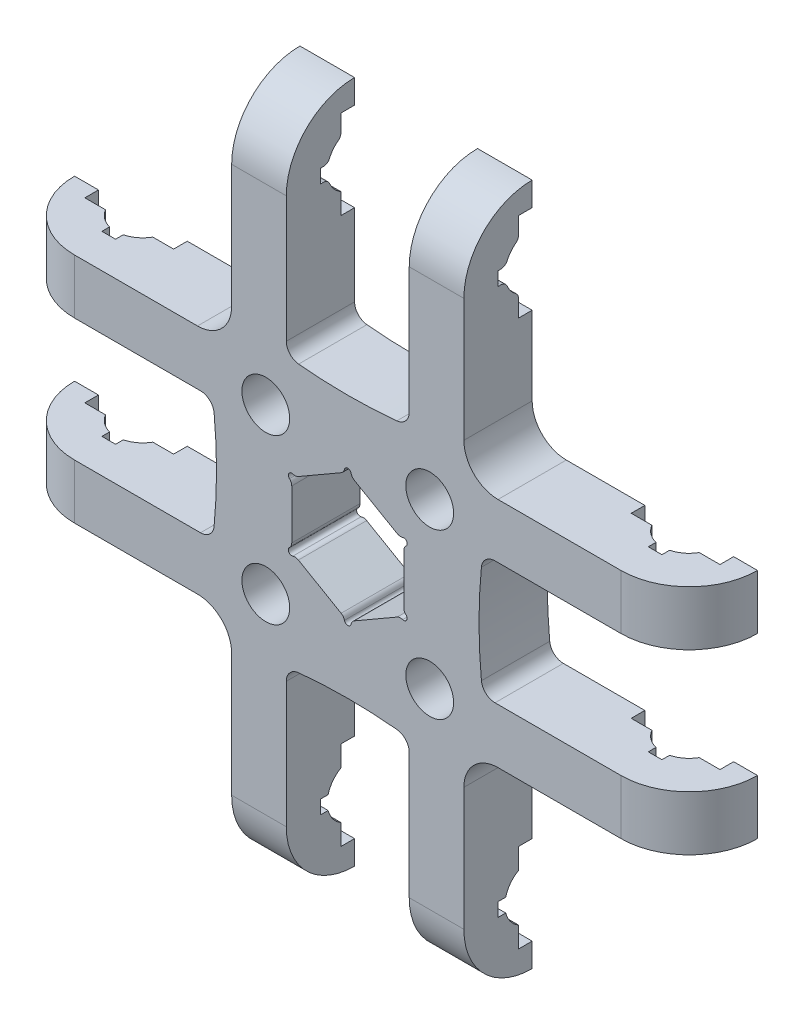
from build123d import *

# Parameters (mm, degrees)
BOSS_EXTRUDE1_DEPTH     = 10
SKETCH4_R               = 2
SKETCH4_W               = 2
SKETCH4_H               = 6.5
SKETCH4_W_2             = 5
SKETCH4_H_2             = 1
CUT_EXTRUDE3_DEPTH      = 46.885165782
SKETCH4_4_W             = 10
SKETCH4_4_H             = 0.975926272
CUT_EXTRUDE4_DEPTH      = 46.885165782
CIRPATTERN1_COUNT       = 4
FILLET1_R               = 2.5
FILLET2_R               = 1
CUT_EXTRUDE5_DEPTH      = 37.742346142
CUT_EXTRUDE5_DEPTH_BACK = 37.742346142
SKETCH5_R               = 0.25
FILLET3_R               = 0.5
FILLET4_R               = 0.5
CUT_EXTRUDE6_DEPTH      = 37.742346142
CUT_EXTRUDE6_DEPTH_BACK = 37.742346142
SKETCH7_W               = 50
SKETCH7_H               = 5
CUT_EXTRUDE7_DEPTH      = 36.707142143
CUT_EXTRUDE7_DEPTH_BACK = 36.707142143
SKETCH8_R               = 1.75


with BuildPart() as part:
    # Sketch1 → Boss-Extrude1 (new body)
    with BuildSketch(Plane.XY):
        with BuildLine():
            ThreePointArc((8.5, 26.153393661), (6.518290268, 26.716322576), (4.5, 27.129319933))
            Line((4.5, 27.129319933), (4.5, 9.884822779))
            ThreePointArc((4.5, 9.884822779), (0, 9.60763872), (-4.5, 9.884822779))
            Line((-4.5, 9.884822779), (-4.5, 27.129319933))
            ThreePointArc((-4.5, 27.129319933), (-6.518290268, 26.716322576), (-8.5, 26.153393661))
            Line((-8.5, 26.153393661), (-8.5, 8.5))
            Line((-8.5, 8.5), (-26.153393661, 8.5))
            ThreePointArc((-26.153393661, 8.5), (-26.716322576, 6.518290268), (-27.129319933, 4.5))
            Line((-27.129319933, 4.5), (-9.884822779, 4.5))
            ThreePointArc((-9.884822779, 4.5), (-9.60763872, 0), (-9.884822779, -4.5))
            Line((-9.884822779, -4.5), (-27.129319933, -4.5))
            ThreePointArc((-27.129319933, -4.5), (-26.716322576, -6.518290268), (-26.153393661, -8.5))
            Line((-26.153393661, -8.5), (-8.5, -8.5))
            Line((-8.5, -8.5), (-8.5, -26.153393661))
            ThreePointArc((-8.5, -26.153393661), (-6.518290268, -26.716322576), (-4.5, -27.129319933))
            Line((-4.5, -27.129319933), (-4.5, -9.884822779))
            ThreePointArc((-4.5, -9.884822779), (0, -9.60763872), (4.5, -9.884822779))
            Line((4.5, -9.884822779), (4.5, -27.129319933))
            ThreePointArc((4.5, -27.129319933), (6.518290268, -26.716322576), (8.5, -26.153393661))
            Line((8.5, -26.153393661), (8.5, -8.5))
            Line((8.5, -8.5), (26.153393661, -8.5))
            ThreePointArc((26.153393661, -8.5), (26.716322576, -6.518290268), (27.129319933, -4.5))
            Line((27.129319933, -4.5), (9.884822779, -4.5))
            ThreePointArc((9.884822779, -4.5), (9.60763872, 0), (9.884822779, 4.5))
            Line((9.884822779, 4.5), (27.129319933, 4.5))
            ThreePointArc((27.129319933, 4.5), (26.716322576, 6.518290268), (26.153393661, 8.5))
            Line((26.153393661, 8.5), (8.5, 8.5))
            Line((8.5, 8.5), (8.5, 26.153393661))
        make_face()
    extrude(amount=BOSS_EXTRUDE1_DEPTH)

    # Sketch4 → Cut-Extrude3 (cut, symmetric)
    with BuildSketch(Plane(origin=(8.5, 0, 0), x_dir=(0, 0, -1), z_dir=(1, 0, 0))):
        with Locations((-5, 20)):
            Circle(SKETCH4_R)
        with Locations((-5, 20)):
            Rectangle(SKETCH4_W, SKETCH4_H)
        with Locations((-5, 20)):
            Rectangle(SKETCH4_W_2, SKETCH4_H_2)
    cut_extrude3 = extrude(amount=CUT_EXTRUDE3_DEPTH, both=True, mode=Mode.SUBTRACT)

    # Sketch4_4 → Cut-Extrude4 (cut, symmetric)
    with BuildSketch(Plane(origin=(8.5, 0, 0), x_dir=(0, 0, -1), z_dir=(1, 0, 0))):
        with BuildLine():
            ThreePointArc((-10, 20), (-5, 25), (0, 20))
            Line((0, 20), (0, 26.153393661))
            Line((0, 26.153393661), (-10, 26.153393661))
            Line((-10, 26.153393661), (-10, 20))
        make_face()
        with Locations((-5, 26.641356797)):
            Rectangle(SKETCH4_4_W, SKETCH4_4_H)
    cut_extrude4 = extrude(amount=CUT_EXTRUDE4_DEPTH, both=True, mode=Mode.SUBTRACT)

    # CirPattern1: Cut-Extrude3, Cut-Extrude4 ×4 about axis
    cirpattern1_axis = Axis((0, 0, 0), (0, 0, 1))
    add([cut_extrude3.rotate(cirpattern1_axis, i * 360 / CIRPATTERN1_COUNT) for i in range(1, CIRPATTERN1_COUNT)], mode=Mode.SUBTRACT)
    add([cut_extrude4.rotate(cirpattern1_axis, i * 360 / CIRPATTERN1_COUNT) for i in range(1, CIRPATTERN1_COUNT)], mode=Mode.SUBTRACT)

    # Fillet1
    fillet1_edges = [part.edges().sort_by_distance(p)[0] for p in [
        (8.5, 8.5, 5),
        (8.5, -8.5, 5),
        (-8.5, -8.5, 5),
        (-8.5, 8.5, 5),
    ]]
    fillet(fillet1_edges, radius=FILLET1_R)

    # Fillet2
    fillet2_edges = [part.edges().sort_by_distance(p)[0] for p in [
        (-4.5, 9.884822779, 5),
        (4.5, 9.884822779, 5),
        (9.884822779, 4.5, 5),
        (9.884822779, -4.5, 5),
        (4.5, -9.884822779, 5),
        (-4.5, -9.884822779, 5),
        (-9.884822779, -4.5, 5),
        (-9.884822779, 4.5, 5),
    ]]
    fillet(fillet2_edges, radius=FILLET2_R)

    # Sketch5 → Cut-Extrude5 (cut, two sides: drawn at the far end of the back side and taken through both)
    with BuildSketch(Plane.XY.offset(10).offset(-CUT_EXTRUDE5_DEPTH_BACK)):
        with Locations((0, 4.734272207)):
            Circle(SKETCH5_R)
        with Locations((-4.1, 2.367136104)):
            Circle(SKETCH5_R)
        with Locations((-4.1, -2.367136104)):
            Circle(SKETCH5_R)
        with Locations((0, -4.734272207)):
            Circle(SKETCH5_R)
        with Locations((4.1, -2.367136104)):
            Circle(SKETCH5_R)
        with Locations((4.1, 2.367136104)):
            Circle(SKETCH5_R)
        Polygon((0, 4.734272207), (-4.1, 2.367136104), (-4.1, -2.367136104), (0, -4.734272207), (4.1, -2.367136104), (4.1, 2.367136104), align=None)
        with BuildLine():
            ThreePointArc((-0.216506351, 4.609272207), (0, 4.484272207), (0.216506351, 4.609272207))
            Line((0.216506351, 4.609272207), (0, 4.734272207))
            Line((0, 4.734272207), (-0.216506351, 4.609272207))
        make_face()
        with BuildLine():
            Line((0, 4.734272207), (0.216506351, 4.609272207))
            ThreePointArc((0.216506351, 4.609272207), (0.241481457, 4.669567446), (0.25, 4.734272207))
            ThreePointArc((0.25, 4.734272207), (-0.064704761, 4.975753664), (-0.216506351, 4.609272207))
            Line((-0.216506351, 4.609272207), (0, 4.734272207))
        make_face()
        with BuildLine():
            ThreePointArc((-0.216506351, 4.609272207), (0, 4.484272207), (0.216506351, 4.609272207))
            Line((0.216506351, 4.609272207), (0, 4.734272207))
            Line((0, 4.734272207), (-0.216506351, 4.609272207))
        make_face()
        with BuildLine():
            Line((0, 4.734272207), (0.216506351, 4.609272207))
            ThreePointArc((0.216506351, 4.609272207), (0.241481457, 4.669567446), (0.25, 4.734272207))
            ThreePointArc((0.25, 4.734272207), (-0.064704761, 4.975753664), (-0.216506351, 4.609272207))
            Line((-0.216506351, 4.609272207), (0, 4.734272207))
        make_face()
        with BuildLine():
            ThreePointArc((3.883493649, 2.492136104), (3.883493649, 2.242136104), (4.1, 2.117136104))
            Line((4.1, 2.117136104), (4.1, 2.367136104))
            Line((4.1, 2.367136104), (3.883493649, 2.492136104))
        make_face()
        with BuildLine():
            Line((4.1, 2.367136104), (4.1, 2.117136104))
            ThreePointArc((4.1, 2.117136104), (4.276776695, 2.190359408), (4.35, 2.367136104))
            ThreePointArc((4.35, 2.367136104), (4.164704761, 2.60861756), (3.883493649, 2.492136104))
            Line((3.883493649, 2.492136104), (4.1, 2.367136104))
        make_face()
        with BuildLine():
            ThreePointArc((3.883493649, 2.492136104), (3.883493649, 2.242136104), (4.1, 2.117136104))
            Line((4.1, 2.117136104), (4.1, 2.367136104))
            Line((4.1, 2.367136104), (3.883493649, 2.492136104))
        make_face()
        with BuildLine():
            Line((4.1, 2.367136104), (4.1, 2.117136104))
            ThreePointArc((4.1, 2.117136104), (4.276776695, 2.190359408), (4.35, 2.367136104))
            ThreePointArc((4.35, 2.367136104), (4.164704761, 2.60861756), (3.883493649, 2.492136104))
            Line((3.883493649, 2.492136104), (4.1, 2.367136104))
        make_face()
        with BuildLine():
            ThreePointArc((-3.883493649, 2.492136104), (-4.316506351, 2.492136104), (-4.1, 2.117136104))
            Line((-4.1, 2.117136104), (-4.1, 2.367136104))
            Line((-4.1, 2.367136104), (-3.883493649, 2.492136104))
        make_face()
        with BuildLine():
            Line((-4.1, 2.367136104), (-4.1, 2.117136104))
            ThreePointArc((-4.1, 2.117136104), (-3.923223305, 2.190359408), (-3.85, 2.367136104))
            ThreePointArc((-3.85, 2.367136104), (-3.858518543, 2.431840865), (-3.883493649, 2.492136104))
            Line((-3.883493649, 2.492136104), (-4.1, 2.367136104))
        make_face()
        with BuildLine():
            ThreePointArc((-3.883493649, 2.492136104), (-4.316506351, 2.492136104), (-4.1, 2.117136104))
            Line((-4.1, 2.117136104), (-4.1, 2.367136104))
            Line((-4.1, 2.367136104), (-3.883493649, 2.492136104))
        make_face()
        with BuildLine():
            Line((-4.1, 2.367136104), (-4.1, 2.117136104))
            ThreePointArc((-4.1, 2.117136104), (-3.923223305, 2.190359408), (-3.85, 2.367136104))
            ThreePointArc((-3.85, 2.367136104), (-3.858518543, 2.431840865), (-3.883493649, 2.492136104))
            Line((-3.883493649, 2.492136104), (-4.1, 2.367136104))
        make_face()
        with BuildLine():
            ThreePointArc((-4.1, -2.117136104), (-4.316506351, -2.492136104), (-3.883493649, -2.492136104))
            Line((-3.883493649, -2.492136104), (-4.1, -2.367136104))
            Line((-4.1, -2.367136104), (-4.1, -2.117136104))
        make_face()
        with BuildLine():
            Line((-4.1, -2.367136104), (-3.883493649, -2.492136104))
            ThreePointArc((-3.883493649, -2.492136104), (-3.858518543, -2.431840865), (-3.85, -2.367136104))
            ThreePointArc((-3.85, -2.367136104), (-3.923223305, -2.190359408), (-4.1, -2.117136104))
            Line((-4.1, -2.117136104), (-4.1, -2.367136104))
        make_face()
        with BuildLine():
            ThreePointArc((-4.1, -2.117136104), (-4.316506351, -2.492136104), (-3.883493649, -2.492136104))
            Line((-3.883493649, -2.492136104), (-4.1, -2.367136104))
            Line((-4.1, -2.367136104), (-4.1, -2.117136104))
        make_face()
        with BuildLine():
            Line((-4.1, -2.367136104), (-3.883493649, -2.492136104))
            ThreePointArc((-3.883493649, -2.492136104), (-3.858518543, -2.431840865), (-3.85, -2.367136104))
            ThreePointArc((-3.85, -2.367136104), (-3.923223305, -2.190359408), (-4.1, -2.117136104))
            Line((-4.1, -2.117136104), (-4.1, -2.367136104))
        make_face()
        with BuildLine():
            Line((-0.216506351, -4.609272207), (0, -4.734272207))
            Line((0, -4.734272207), (0.216506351, -4.609272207))
            ThreePointArc((0.216506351, -4.609272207), (0, -4.484272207), (-0.216506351, -4.609272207))
        make_face()
        with BuildLine():
            Line((0.216506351, -4.609272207), (0, -4.734272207))
            Line((0, -4.734272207), (-0.216506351, -4.609272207))
            ThreePointArc((-0.216506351, -4.609272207), (-0.064704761, -4.975753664), (0.25, -4.734272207))
            ThreePointArc((0.25, -4.734272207), (0.241481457, -4.669567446), (0.216506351, -4.609272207))
        make_face()
        with BuildLine():
            Line((-0.216506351, -4.609272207), (0, -4.734272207))
            Line((0, -4.734272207), (0.216506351, -4.609272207))
            ThreePointArc((0.216506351, -4.609272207), (0, -4.484272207), (-0.216506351, -4.609272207))
        make_face()
        with BuildLine():
            Line((0.216506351, -4.609272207), (0, -4.734272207))
            Line((0, -4.734272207), (-0.216506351, -4.609272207))
            ThreePointArc((-0.216506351, -4.609272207), (-0.064704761, -4.975753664), (0.25, -4.734272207))
            ThreePointArc((0.25, -4.734272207), (0.241481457, -4.669567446), (0.216506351, -4.609272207))
        make_face()
        with BuildLine():
            ThreePointArc((4.1, -2.117136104), (3.883493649, -2.242136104), (3.883493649, -2.492136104))
            Line((3.883493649, -2.492136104), (4.1, -2.367136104))
            Line((4.1, -2.367136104), (4.1, -2.117136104))
        make_face()
        with BuildLine():
            Line((4.1, -2.367136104), (3.883493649, -2.492136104))
            ThreePointArc((3.883493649, -2.492136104), (4.164704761, -2.60861756), (4.35, -2.367136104))
            ThreePointArc((4.35, -2.367136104), (4.276776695, -2.190359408), (4.1, -2.117136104))
            Line((4.1, -2.117136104), (4.1, -2.367136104))
        make_face()
        with BuildLine():
            ThreePointArc((4.1, -2.117136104), (3.883493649, -2.242136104), (3.883493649, -2.492136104))
            Line((3.883493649, -2.492136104), (4.1, -2.367136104))
            Line((4.1, -2.367136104), (4.1, -2.117136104))
        make_face()
        with BuildLine():
            Line((4.1, -2.367136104), (3.883493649, -2.492136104))
            ThreePointArc((3.883493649, -2.492136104), (4.164704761, -2.60861756), (4.35, -2.367136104))
            ThreePointArc((4.35, -2.367136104), (4.276776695, -2.190359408), (4.1, -2.117136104))
            Line((4.1, -2.117136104), (4.1, -2.367136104))
        make_face()
    extrude(amount=CUT_EXTRUDE5_DEPTH + CUT_EXTRUDE5_DEPTH_BACK, mode=Mode.SUBTRACT)

    # Fillet3
    fillet3_edges = [part.edges().sort_by_distance(p)[0] for p in [
        (-0.216506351, 4.609272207, 5),
        (0.216506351, 4.609272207, 5),
        (3.883493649, 2.492136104, 5),
        (4.1, 2.117136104, 5),
        (4.1, -2.117136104, 5),
        (3.883493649, -2.492136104, 5),
        (0.216506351, -4.609272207, 5),
        (-0.216506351, -4.609272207, 5),
        (-3.883493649, -2.492136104, 5),
        (-4.1, -2.117136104, 5),
        (-4.1, 2.117136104, 5),
        (-3.883493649, 2.492136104, 5),
    ]]
    fillet(fillet3_edges, radius=FILLET3_R)

    # Fillet4
    fillet4_edges = [part.edges().sort_by_distance(p)[0] for p in [
        (-6.5, 19.5, 3.063508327),
        (6.5, 19.5, 3.063508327),
        (-6.5, 18.267949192, 4),
        (6.5, 18.267949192, 4),
        (6.5, 18.267949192, 6),
        (-6.5, 19.5, 6.936491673),
        (6.5, 19.5, 6.936491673),
        (-6.5, 20.5, 6.936491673),
        (6.5, 20.5, 6.936491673),
        (-6.5, 21.732050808, 6),
        (6.5, 21.732050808, 6),
        (-6.5, 21.732050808, 4),
        (6.5, 21.732050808, 4),
        (-6.5, 20.5, 3.063508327),
        (6.5, 20.5, 3.063508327),
    ]]
    fillet(fillet4_edges, radius=FILLET4_R)

    # Sketch7 → Cut-Extrude6 (cut, two sides: drawn at the far end of the back side and taken through both)
    with BuildSketch(Plane(origin=(0, 0, 0), x_dir=(1, 0, 0), z_dir=(0, 1, 0)).offset(-CUT_EXTRUDE6_DEPTH_BACK)):
        with Locations((0, -2.5)):
            Rectangle(SKETCH7_W, SKETCH7_H)
    extrude(amount=CUT_EXTRUDE6_DEPTH + CUT_EXTRUDE6_DEPTH_BACK, mode=Mode.SUBTRACT)

    # Sketch8 → Cut-Extrude7 (cut, two sides: drawn at the far end of the back side and taken through both)
    with BuildSketch(Plane.XY.offset(10).offset(-CUT_EXTRUDE7_DEPTH_BACK)):
        with Locations((6, -6)):
            Circle(SKETCH8_R)
        with Locations((-6, -6)):
            Circle(SKETCH8_R)
        with Locations((-6, 6)):
            Circle(SKETCH8_R)
        with Locations((6, 6)):
            Circle(SKETCH8_R)
    extrude(amount=CUT_EXTRUDE7_DEPTH + CUT_EXTRUDE7_DEPTH_BACK, mode=Mode.SUBTRACT)


solid = part.part
